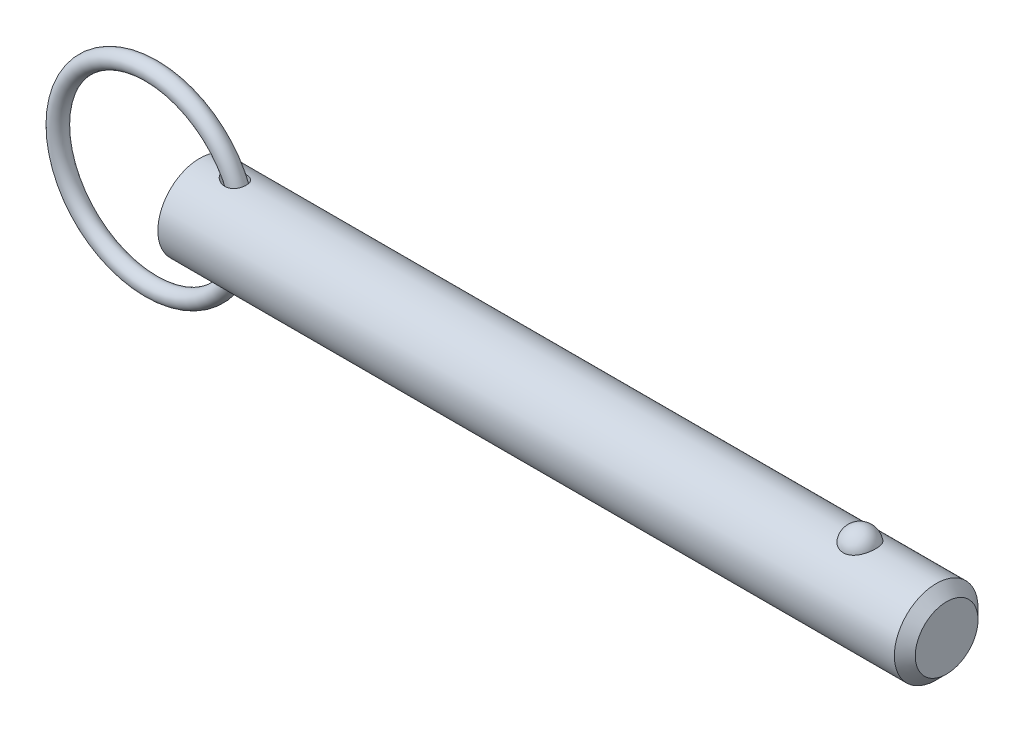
ISO-10303-21;
HEADER;
FILE_DESCRIPTION(('STEP AP214'),'2;1');
FILE_NAME('part.step','',(''),(''),'','','');
FILE_SCHEMA(('AUTOMOTIVE_DESIGN { 1 0 10303 214 1 1 1 1 }'));
ENDSEC;
DATA;
#1=APPLICATION_CONTEXT('core data for automotive mechanical design processes');
#2=APPLICATION_PROTOCOL_DEFINITION('international standard','automotive_design',2000,#1);
#3=PRODUCT_CONTEXT('',#1,'mechanical');
#4=PRODUCT('Part','Part','',(#3));
#5=PRODUCT_RELATED_PRODUCT_CATEGORY('part','',(#4));
#6=PRODUCT_DEFINITION_FORMATION('','',#4);
#7=PRODUCT_DEFINITION_CONTEXT('part definition',#1,'design');
#8=PRODUCT_DEFINITION('design','',#6,#7);
#9=PRODUCT_DEFINITION_SHAPE('','',#8);
#10=(LENGTH_UNIT() NAMED_UNIT(*) SI_UNIT(.MILLI.,.METRE.));
#11=(NAMED_UNIT(*) PLANE_ANGLE_UNIT() SI_UNIT($,.RADIAN.));
#12=(NAMED_UNIT(*) SI_UNIT($,.STERADIAN.) SOLID_ANGLE_UNIT());
#13=UNCERTAINTY_MEASURE_WITH_UNIT(LENGTH_MEASURE(1.E-05),#10,'distance_accuracy_value','');
#14=(GEOMETRIC_REPRESENTATION_CONTEXT(3) GLOBAL_UNCERTAINTY_ASSIGNED_CONTEXT((#13)) GLOBAL_UNIT_ASSIGNED_CONTEXT((#10,
#11,#12)) REPRESENTATION_CONTEXT('',''));
#15=CARTESIAN_POINT('',(0.,0.,0.));
#16=DIRECTION('',(0.,0.,1.));
#17=DIRECTION('',(1.,0.,0.));
#18=AXIS2_PLACEMENT_3D('',#15,#16,#17);
#19=CARTESIAN_POINT('',(-8.23730968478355,0.,0.));
#20=DIRECTION('',(0.,0.,1.));
#21=DIRECTION('',(1.,0.,0.));
#22=AXIS2_PLACEMENT_3D('',#19,#20,#21);
#23=TOROIDAL_SURFACE('',#22,15.875,1.422);
#24=CARTESIAN_POINT('',(9.05969031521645,0.,0.));
#25=VERTEX_POINT('',#24);
#26=VERTEX_LOOP('',#25);
#27=FACE_BOUND('',#26,.T.);
#28=ADVANCED_FACE('P0_F12',(#27),#23,.T.);
#29=CLOSED_SHELL('',(#28));
#30=MANIFOLD_SOLID_BREP('P0_B1',#29);
#31=CARTESIAN_POINT('',(0.,0.,0.));
#32=DIRECTION('',(1.,0.,0.));
#33=DIRECTION('',(0.,0.,-1.));
#34=AXIS2_PLACEMENT_3D('',#31,#32,#33);
#35=CYLINDRICAL_SURFACE('',#34,7.11);
#36=CARTESIAN_POINT('',(3.98467340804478,7.10072679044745,-0.363013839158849));
#37=CARTESIAN_POINT('',(4.00971652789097,7.09600153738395,-0.45539194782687));
#38=CARTESIAN_POINT('',(4.04401947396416,7.08958406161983,-0.545230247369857));
#39=CARTESIAN_POINT('',(4.12810160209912,7.07427055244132,-0.717157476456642));
#40=CARTESIAN_POINT('',(4.17791765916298,7.06536861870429,-0.799227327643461));
#41=CARTESIAN_POINT('',(4.28924471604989,7.04620300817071,-0.953469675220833));
#42=CARTESIAN_POINT('',(4.35063580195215,7.035953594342,-1.02573162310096));
#43=CARTESIAN_POINT('',(4.48282610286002,7.01493313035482,-1.16081412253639));
#44=CARTESIAN_POINT('',(4.55362244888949,7.00416223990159,-1.22363754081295));
#45=CARTESIAN_POINT('',(4.71659336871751,6.98090398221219,-1.35055080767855));
#46=CARTESIAN_POINT('',(4.81029272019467,6.96847103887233,-1.41269256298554));
#47=CARTESIAN_POINT('',(5.0057240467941,6.94515366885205,-1.52319699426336));
#48=CARTESIAN_POINT('',(5.10746392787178,6.93427079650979,-1.57154588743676));
#49=CARTESIAN_POINT('',(5.33503739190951,6.91346066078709,-1.66091325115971));
#50=CARTESIAN_POINT('',(5.46199550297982,6.90402388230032,-1.69921932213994));
#51=CARTESIAN_POINT('',(5.72084799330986,6.89024030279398,-1.75428261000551));
#52=CARTESIAN_POINT('',(5.85274301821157,6.88589416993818,-1.77103699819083));
#53=CARTESIAN_POINT('',(6.11557710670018,6.88337277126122,-1.78081990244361));
#54=CARTESIAN_POINT('',(6.24650031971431,6.88510489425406,-1.77420448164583));
#55=CARTESIAN_POINT('',(6.50446311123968,6.89478744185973,-1.73620392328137));
#56=CARTESIAN_POINT('',(6.6315075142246,6.90272978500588,-1.70485097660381));
#57=CARTESIAN_POINT('',(6.85933269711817,6.92243075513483,-1.62281888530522));
#58=CARTESIAN_POINT('',(6.96133251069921,6.93352131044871,-1.5753580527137));
#59=CARTESIAN_POINT('',(7.15436649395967,6.95824811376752,-1.46226310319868));
#60=CARTESIAN_POINT('',(7.24540699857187,6.97188287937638,-1.3966395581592));
#61=CARTESIAN_POINT('',(7.40446019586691,6.99838217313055,-1.25668991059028));
#62=CARTESIAN_POINT('',(7.473875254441,7.01118308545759,-1.18393777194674));
#63=CARTESIAN_POINT('',(7.59904891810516,7.03582803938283,-1.02736918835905));
#64=CARTESIAN_POINT('',(7.65481029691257,7.04767227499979,-0.943554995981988));
#65=CARTESIAN_POINT('',(7.74982438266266,7.06873077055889,-0.76979592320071));
#66=CARTESIAN_POINT('',(7.7894903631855,7.07800861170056,-0.680084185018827));
#67=CARTESIAN_POINT('',(7.85354088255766,7.09334756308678,-0.495102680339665));
#68=CARTESIAN_POINT('',(7.87792559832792,7.09940871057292,-0.399832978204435));
#69=CARTESIAN_POINT('',(7.9108898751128,7.10766731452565,-0.206294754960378));
#70=CARTESIAN_POINT('',(7.91944662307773,7.10985919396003,-0.108022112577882));
#71=CARTESIAN_POINT('',(7.920501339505,7.11012756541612,0.0886168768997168));
#72=CARTESIAN_POINT('',(7.91299895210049,7.10820396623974,0.186983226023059));
#73=CARTESIAN_POINT('',(7.88205794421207,7.10043733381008,0.381270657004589));
#74=CARTESIAN_POINT('',(7.85857985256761,7.09458459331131,0.477185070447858));
#75=CARTESIAN_POINT('',(7.79617406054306,7.07958431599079,0.663575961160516));
#76=CARTESIAN_POINT('',(7.75724672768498,7.07043685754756,0.754052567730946));
#77=CARTESIAN_POINT('',(7.66496731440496,7.04987259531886,0.926798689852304));
#78=CARTESIAN_POINT('',(7.61164530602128,7.0384605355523,1.00908483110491));
#79=CARTESIAN_POINT('',(7.49191707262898,7.01461776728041,1.16333092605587));
#80=CARTESIAN_POINT('',(7.42551210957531,7.00218715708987,1.235291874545));
#81=CARTESIAN_POINT('',(7.28164031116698,6.97770944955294,1.36680167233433));
#82=CARTESIAN_POINT('',(7.20420170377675,6.96566146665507,1.42638126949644));
#83=CARTESIAN_POINT('',(7.0403906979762,6.94319963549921,1.53199377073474));
#84=CARTESIAN_POINT('',(6.95401827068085,6.93278579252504,1.57802663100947));
#85=CARTESIAN_POINT('',(6.7731858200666,6.91444459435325,1.65656940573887));
#86=CARTESIAN_POINT('',(6.67860569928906,6.90656682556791,1.68881327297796));
#87=CARTESIAN_POINT('',(6.48544119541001,6.89422806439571,1.73849768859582));
#88=CARTESIAN_POINT('',(6.38685561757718,6.88976809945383,1.755933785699));
#89=CARTESIAN_POINT('',(6.18089829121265,6.88429907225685,1.77726234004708));
#90=CARTESIAN_POINT('',(6.07340937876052,6.88356485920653,1.78007646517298));
#91=CARTESIAN_POINT('',(5.85921220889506,6.886086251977,1.77029087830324));
#92=CARTESIAN_POINT('',(5.75250426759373,6.88934339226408,1.75768523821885));
#93=CARTESIAN_POINT('',(5.52848027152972,6.89994454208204,1.71563399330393));
#94=CARTESIAN_POINT('',(5.41155168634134,6.90775772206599,1.68424184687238));
#95=CARTESIAN_POINT('',(5.18376466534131,6.92670168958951,1.60454711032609));
#96=CARTESIAN_POINT('',(5.07291446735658,6.9378368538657,1.5562221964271));
#97=CARTESIAN_POINT('',(4.84835244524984,6.96347168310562,1.43744827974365));
#98=CARTESIAN_POINT('',(4.73562531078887,6.97820486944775,1.36517310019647));
#99=CARTESIAN_POINT('',(4.52504912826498,7.00822340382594,1.20158053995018));
#100=CARTESIAN_POINT('',(4.42717478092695,7.02350775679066,1.11029618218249));
#101=CARTESIAN_POINT('',(4.27935716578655,7.04784659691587,0.940654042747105));
#102=CARTESIAN_POINT('',(4.2239722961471,7.05736064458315,0.867099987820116));
#103=CARTESIAN_POINT('',(4.12558347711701,7.07469854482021,0.711919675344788));
#104=CARTESIAN_POINT('',(4.08256922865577,7.0825238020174,0.630300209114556));
#105=CARTESIAN_POINT('',(4.01142860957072,7.09565978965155,0.459428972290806));
#106=CARTESIAN_POINT('',(3.98346043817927,7.10094374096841,0.370107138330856));
#107=CARTESIAN_POINT('',(3.95517285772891,7.1063173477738,0.233358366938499));
#108=CARTESIAN_POINT('',(3.94802115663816,7.1076831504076,0.187321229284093));
#109=CARTESIAN_POINT('',(3.93842121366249,7.10951900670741,0.0947476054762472));
#110=CARTESIAN_POINT('',(3.93597129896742,7.10998937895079,0.0482113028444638));
#111=CARTESIAN_POINT('',(3.93584361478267,7.11001358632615,-0.0598597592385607));
#112=CARTESIAN_POINT('',(3.9399538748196,7.10922402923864,-0.121405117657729));
#113=CARTESIAN_POINT('',(3.95632793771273,7.10609781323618,-0.243320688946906));
#114=CARTESIAN_POINT('',(3.96859135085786,7.10376122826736,-0.303690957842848));
#115=CARTESIAN_POINT('',(3.98467340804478,7.10072679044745,-0.363013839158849));
#116=B_SPLINE_CURVE_WITH_KNOTS('',3,(#36,#37,#38,#39,#40,#41,#42,#43,#44,#45,#46,#47,#48,#49,
#50,#51,#52,#53,#54,#55,#56,#57,#58,#59,#60,#61,#62,#63,#64,#65,#66,#67,#68,#69,#70,#71,#72,#73,
#74,#75,#76,#77,#78,#79,#80,#81,#82,#83,#84,#85,#86,#87,#88,#89,#90,#91,#92,#93,#94,#95,#96,#97,
#98,#99,#100,#101,#102,#103,#104,#105,#106,#107,#108,#109,#110,#111,#112,#113,#114,#115),
.UNSPECIFIED.,.T.,.F.,(4,2,2,2,2,2,2,2,2,2,2,2,2,2,2,2,2,2,2,2,2,2,2,2,2,2,2,2,2,2,2,2,2,2,2,2,
2,2,2,4),(0.,0.287206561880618,0.575101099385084,0.860162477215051,1.14513709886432,
1.48324846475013,1.82169652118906,2.21865672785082,2.6156690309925,3.00665870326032,
3.39714041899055,3.73437585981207,4.07141541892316,4.37402271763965,4.67656849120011,
4.97076150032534,5.26495110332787,5.55956439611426,5.85418421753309,6.14953461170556,
6.44487798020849,6.73960905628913,7.03431171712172,7.32827352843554,7.6222362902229,
7.9216396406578,8.22113296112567,8.54242840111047,8.86384740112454,9.22635035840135,
9.58933304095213,9.99153142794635,10.3930368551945,10.6697219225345,10.9461759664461,
11.2254825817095,11.3650959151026,11.5046595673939,11.6891051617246,11.8735419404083),.UNSPECIFIED.);
#117=CARTESIAN_POINT('',(3.98467340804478,7.10072679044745,-0.363013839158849));
#118=VERTEX_POINT('',#117);
#119=EDGE_CURVE('P1_E40',#118,#118,#116,.T.);
#120=ORIENTED_EDGE('',*,*,#119,.T.);
#121=EDGE_LOOP('',(#120));
#122=FACE_BOUND('',#121,.T.);
#123=CARTESIAN_POINT('',(125.1925,0.,0.));
#124=DIRECTION('',(1.,0.,0.));
#125=DIRECTION('',(0.,0.,-1.));
#126=AXIS2_PLACEMENT_3D('',#123,#124,#125);
#127=CIRCLE('',#126,7.11);
#128=CARTESIAN_POINT('',(125.1925,0.,-7.11));
#129=VERTEX_POINT('',#128);
#130=EDGE_CURVE('P1_E25',#129,#129,#127,.T.);
#131=ORIENTED_EDGE('',*,*,#130,.F.);
#132=EDGE_LOOP('',(#131));
#133=FACE_BOUND('',#132,.T.);
#134=CARTESIAN_POINT('',(0.,0.,0.));
#135=DIRECTION('',(1.,0.,0.));
#136=DIRECTION('',(0.,0.,-1.));
#137=AXIS2_PLACEMENT_3D('',#134,#135,#136);
#138=CIRCLE('',#137,7.11);
#139=CARTESIAN_POINT('',(0.,0.,-7.11));
#140=VERTEX_POINT('',#139);
#141=EDGE_CURVE('P1_E9',#140,#140,#138,.T.);
#142=ORIENTED_EDGE('',*,*,#141,.T.);
#143=EDGE_LOOP('',(#142));
#144=FACE_BOUND('',#143,.T.);
#145=CARTESIAN_POINT('',(112.229258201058,6.5364666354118,2.79762469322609));
#146=CARTESIAN_POINT('',(112.084429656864,6.53647876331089,2.79761243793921));
#147=CARTESIAN_POINT('',(111.939368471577,6.54144531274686,2.78608115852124));
#148=CARTESIAN_POINT('',(111.653292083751,6.56077791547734,2.7402328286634));
#149=CARTESIAN_POINT('',(111.512288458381,6.5751685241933,2.7058562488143));
#150=CARTESIAN_POINT('',(111.23888335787,6.61165072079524,2.61544042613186));
#151=CARTESIAN_POINT('',(111.106460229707,6.63372195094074,2.55945840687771));
#152=CARTESIAN_POINT('',(110.853233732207,6.68316012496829,2.42742958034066));
#153=CARTESIAN_POINT('',(110.732425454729,6.71052481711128,2.35139129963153));
#154=CARTESIAN_POINT('',(110.501637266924,6.76860821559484,2.17866150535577));
#155=CARTESIAN_POINT('',(110.392085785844,6.79940242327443,2.0814234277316));
#156=CARTESIAN_POINT('',(110.19033404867,6.86050242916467,1.87020907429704));
#157=CARTESIAN_POINT('',(110.098139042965,6.89080807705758,1.75622775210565));
#158=CARTESIAN_POINT('',(109.92925478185,6.94923069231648,1.50900646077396));
#159=CARTESIAN_POINT('',(109.853428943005,6.97719213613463,1.37513873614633));
#160=CARTESIAN_POINT('',(109.724206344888,7.02647251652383,1.09584817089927));
#161=CARTESIAN_POINT('',(109.670810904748,7.04779106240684,0.95042465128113));
#162=CARTESIAN_POINT('',(109.587101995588,7.08180248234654,0.650508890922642));
#163=CARTESIAN_POINT('',(109.557025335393,7.09440672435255,0.495940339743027));
#164=CARTESIAN_POINT('',(109.521473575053,7.10935121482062,0.183515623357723));
#165=CARTESIAN_POINT('',(109.515997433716,7.11169189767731,0.0256595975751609));
#166=CARTESIAN_POINT('',(109.529700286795,7.10589702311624,-0.28751219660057));
#167=CARTESIAN_POINT('',(109.54868231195,7.0978451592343,-0.442838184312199));
#168=CARTESIAN_POINT('',(109.61057450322,7.07221860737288,-0.747830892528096));
#169=CARTESIAN_POINT('',(109.653485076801,7.05464375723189,-0.897497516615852));
#170=CARTESIAN_POINT('',(109.762452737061,7.01171031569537,-1.18722864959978));
#171=CARTESIAN_POINT('',(109.828545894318,6.98633960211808,-1.32727778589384));
#172=CARTESIAN_POINT('',(109.982536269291,6.93042258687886,-1.59370324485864));
#173=CARTESIAN_POINT('',(110.070435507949,6.89987580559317,-1.72007829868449));
#174=CARTESIAN_POINT('',(110.266926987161,6.83659510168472,-1.95657345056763));
#175=CARTESIAN_POINT('',(110.375664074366,6.80384697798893,-2.06656957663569));
#176=CARTESIAN_POINT('',(110.610968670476,6.74001831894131,-2.26611005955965));
#177=CARTESIAN_POINT('',(110.737535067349,6.70893767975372,-2.35565569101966));
#178=CARTESIAN_POINT('',(111.002845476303,6.65264442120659,-2.51019726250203));
#179=CARTESIAN_POINT('',(111.141323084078,6.62733449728,-2.57561395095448));
#180=CARTESIAN_POINT('',(111.428519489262,6.58495995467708,-2.68211134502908));
#181=CARTESIAN_POINT('',(111.577234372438,6.56789220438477,-2.7232012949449));
#182=CARTESIAN_POINT('',(111.872626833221,6.54478663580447,-2.77825810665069));
#183=CARTESIAN_POINT('',(112.01902951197,6.53823639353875,-2.79348727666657));
#184=CARTESIAN_POINT('',(112.312470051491,6.53532718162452,-2.80028921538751));
#185=CARTESIAN_POINT('',(112.459507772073,6.53896606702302,-2.79186696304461));
#186=CARTESIAN_POINT('',(112.744921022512,6.55570357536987,-2.75232178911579));
#187=CARTESIAN_POINT('',(112.883422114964,6.56848455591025,-2.72196077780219));
#188=CARTESIAN_POINT('',(113.153114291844,6.60173528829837,-2.64028774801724));
#189=CARTESIAN_POINT('',(113.284304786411,6.62220565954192,-2.58897404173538));
#190=CARTESIAN_POINT('',(113.538846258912,6.66917927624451,-2.4654782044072));
#191=CARTESIAN_POINT('',(113.661969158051,6.69580233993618,-2.39287266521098));
#192=CARTESIAN_POINT('',(113.894441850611,6.75207041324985,-2.22915269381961));
#193=CARTESIAN_POINT('',(114.003788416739,6.78171612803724,-2.13803393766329));
#194=CARTESIAN_POINT('',(114.211642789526,6.84264629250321,-1.93445592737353));
#195=CARTESIAN_POINT('',(114.309317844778,6.87393748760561,-1.82114774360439));
#196=CARTESIAN_POINT('',(114.485011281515,6.93345710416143,-1.57947787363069));
#197=CARTESIAN_POINT('',(114.563026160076,6.96168497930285,-1.45111351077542));
#198=CARTESIAN_POINT('',(114.699985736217,7.01307558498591,-1.17842708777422));
#199=CARTESIAN_POINT('',(114.758258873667,7.03605262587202,-1.03373189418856));
#200=CARTESIAN_POINT('',(114.851081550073,7.07340932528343,-0.735867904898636));
#201=CARTESIAN_POINT('',(114.885631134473,7.08778900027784,-0.582699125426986));
#202=CARTESIAN_POINT('',(114.930274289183,7.10647639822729,-0.272420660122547));
#203=CARTESIAN_POINT('',(114.94039710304,7.11079616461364,-0.115315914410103));
#204=CARTESIAN_POINT('',(114.936061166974,7.10896059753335,0.198488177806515));
#205=CARTESIAN_POINT('',(114.921603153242,7.10280557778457,0.355187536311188));
#206=CARTESIAN_POINT('',(114.868572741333,7.08071500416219,0.662724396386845));
#207=CARTESIAN_POINT('',(114.83015058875,7.06484039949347,0.813592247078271));
#208=CARTESIAN_POINT('',(114.730101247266,7.02495896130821,1.10629159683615));
#209=CARTESIAN_POINT('',(114.668472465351,7.00095156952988,1.24812247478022));
#210=CARTESIAN_POINT('',(114.522766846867,6.94706632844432,1.51976439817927));
#211=CARTESIAN_POINT('',(114.438544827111,6.91715085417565,1.64949012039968));
#212=CARTESIAN_POINT('',(114.249586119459,6.8547056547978,1.89231285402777));
#213=CARTESIAN_POINT('',(114.144850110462,6.82217601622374,2.00541041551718));
#214=CARTESIAN_POINT('',(113.917103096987,6.75805358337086,2.21190674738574));
#215=CARTESIAN_POINT('',(113.794082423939,6.72646129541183,2.30529503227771));
#216=CARTESIAN_POINT('',(113.53273470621,6.66789520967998,2.46959908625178));
#217=CARTESIAN_POINT('',(113.394401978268,6.64092313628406,2.54050647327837));
#218=CARTESIAN_POINT('',(113.111182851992,6.59572583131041,2.65560045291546));
#219=CARTESIAN_POINT('',(112.966666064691,6.57724013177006,2.70059539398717));
#220=CARTESIAN_POINT('',(112.671546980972,6.55006426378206,2.76587321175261));
#221=CARTESIAN_POINT('',(112.520964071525,6.54134511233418,2.78622922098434));
#222=CARTESIAN_POINT('',(112.323046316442,6.53697847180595,2.79642434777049));
#223=CARTESIAN_POINT('',(112.276164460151,6.53646270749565,2.79762866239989));
#224=CARTESIAN_POINT('',(112.229258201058,6.5364666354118,2.79762469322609));
#225=B_SPLINE_CURVE_WITH_KNOTS('',3,(#145,#146,#147,#148,#149,#150,#151,#152,#153,#154,#155,
#156,#157,#158,#159,#160,#161,#162,#163,#164,#165,#166,#167,#168,#169,#170,#171,#172,#173,#174,
#175,#176,#177,#178,#179,#180,#181,#182,#183,#184,#185,#186,#187,#188,#189,#190,#191,#192,#193,
#194,#195,#196,#197,#198,#199,#200,#201,#202,#203,#204,#205,#206,#207,#208,#209,#210,#211,#212,
#213,#214,#215,#216,#217,#218,#219,#220,#221,#222,#223,#224),.UNSPECIFIED.,.T.,.F.,(4,2,2,2,2,2,
2,2,2,2,2,2,2,2,2,2,2,2,2,2,2,2,2,2,2,2,2,2,2,2,2,2,2,2,2,2,2,2,2,4),(0.,0.434355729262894,
0.869847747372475,1.30419416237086,1.73835621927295,2.18541922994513,2.63261726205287,
3.09954261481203,3.56649542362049,4.03813031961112,4.5097452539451,4.97758575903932,
5.44543423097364,5.9140138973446,6.38263700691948,6.85464418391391,7.32662193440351,
7.78992971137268,8.25306131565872,8.69285754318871,9.13256119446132,9.5576862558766,
9.9828455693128,10.4171106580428,10.8514772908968,11.3079089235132,11.7644218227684,
12.2351898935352,12.7059570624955,13.1761603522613,13.6463495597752,14.1136200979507,
14.580922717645,15.0513032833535,15.5216682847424,15.9922828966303,16.4630727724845,
16.9182457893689,17.3720644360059,17.5127411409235),.UNSPECIFIED.);
#226=CARTESIAN_POINT('',(112.229258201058,6.5364666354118,2.79762469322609));
#227=VERTEX_POINT('',#226);
#228=EDGE_CURVE('P1_E34',#227,#227,#225,.T.);
#229=ORIENTED_EDGE('',*,*,#228,.T.);
#230=EDGE_LOOP('',(#229));
#231=FACE_BOUND('',#230,.T.);
#232=CARTESIAN_POINT('',(3.98467340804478,-7.10072679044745,-0.363013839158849));
#233=CARTESIAN_POINT('',(3.96426456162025,-7.10457733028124,-0.287714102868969));
#234=CARTESIAN_POINT('',(3.95000501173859,-7.10730349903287,-0.210695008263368));
#235=CARTESIAN_POINT('',(3.93481801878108,-7.11020840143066,-0.0553038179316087));
#236=CARTESIAN_POINT('',(3.93388435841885,-7.11038832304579,0.0230676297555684));
#237=CARTESIAN_POINT('',(3.94541910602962,-7.10817995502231,0.178714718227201));
#238=CARTESIAN_POINT('',(3.95787987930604,-7.10579312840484,0.25599095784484));
#239=CARTESIAN_POINT('',(3.99523775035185,-7.09872642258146,0.407352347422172));
#240=CARTESIAN_POINT('',(4.02014065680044,-7.09404547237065,0.481435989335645));
#241=CARTESIAN_POINT('',(4.08119600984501,-7.08278363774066,0.625775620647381));
#242=CARTESIAN_POINT('',(4.11749458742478,-7.07617815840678,0.695967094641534));
#243=CARTESIAN_POINT('',(4.19940836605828,-7.06165305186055,0.830508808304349));
#244=CARTESIAN_POINT('',(4.24502952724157,-7.0537325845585,0.894855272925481));
#245=CARTESIAN_POINT('',(4.36790232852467,-7.03310314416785,1.04688574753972));
#246=CARTESIAN_POINT('',(4.44977459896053,-7.01993229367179,1.13078695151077));
#247=CARTESIAN_POINT('',(4.62610796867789,-6.99351259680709,1.28411726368));
#248=CARTESIAN_POINT('',(4.7205898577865,-6.98026365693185,1.35352197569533));
#249=CARTESIAN_POINT('',(4.92036507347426,-6.9549104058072,1.47831921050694));
#250=CARTESIAN_POINT('',(5.02579054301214,-6.94282458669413,1.53350332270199));
#251=CARTESIAN_POINT('',(5.24378330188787,-6.92129098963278,1.62793610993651));
#252=CARTESIAN_POINT('',(5.35635066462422,-6.91184323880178,1.66718462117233));
#253=CARTESIAN_POINT('',(5.60134354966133,-6.89573491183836,1.73269893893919));
#254=CARTESIAN_POINT('',(5.73444697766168,-6.8895970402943,1.75661057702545));
#255=CARTESIAN_POINT('',(6.00300738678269,-6.88344616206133,1.78057487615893));
#256=CARTESIAN_POINT('',(6.13846360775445,-6.88343121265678,1.78063510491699));
#257=CARTESIAN_POINT('',(6.39660470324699,-6.88981379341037,1.75576480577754));
#258=CARTESIAN_POINT('',(6.51947843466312,-6.89572457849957,1.73273121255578));
#259=CARTESIAN_POINT('',(6.75813770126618,-6.91274434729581,1.66352936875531));
#260=CARTESIAN_POINT('',(6.87393155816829,-6.92384709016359,1.61738888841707));
#261=CARTESIAN_POINT('',(7.07801861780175,-6.94787316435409,1.51052664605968));
#262=CARTESIAN_POINT('',(7.16789841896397,-6.96033024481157,1.45271574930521));
#263=CARTESIAN_POINT('',(7.33546773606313,-6.98638661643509,1.32171912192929));
#264=CARTESIAN_POINT('',(7.41316182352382,-6.99998547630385,1.24853918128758));
#265=CARTESIAN_POINT('',(7.54861420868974,-7.02559503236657,1.09486170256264));
#266=CARTESIAN_POINT('',(7.60741145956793,-7.03764930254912,1.01528346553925));
#267=CARTESIAN_POINT('',(7.71070740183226,-7.0598657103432,0.847099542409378));
#268=CARTESIAN_POINT('',(7.75520788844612,-7.0700280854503,0.758494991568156));
#269=CARTESIAN_POINT('',(7.82836147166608,-7.08722075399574,0.575936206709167));
#270=CARTESIAN_POINT('',(7.85719783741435,-7.09428707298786,0.482058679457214));
#271=CARTESIAN_POINT('',(7.89918378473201,-7.10470260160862,0.29065874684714));
#272=CARTESIAN_POINT('',(7.91233308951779,-7.10805174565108,0.193136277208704));
#273=CARTESIAN_POINT('',(7.92267451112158,-7.11067890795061,-0.00313968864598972));
#274=CARTESIAN_POINT('',(7.91981203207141,-7.10994299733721,-0.10189624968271));
#275=CARTESIAN_POINT('',(7.89806489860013,-7.10444651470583,-0.297516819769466));
#276=CARTESIAN_POINT('',(7.87918005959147,-7.09968589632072,-0.394380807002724));
#277=CARTESIAN_POINT('',(7.82577988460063,-7.0866471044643,-0.58355375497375));
#278=CARTESIAN_POINT('',(7.79124976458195,-7.07836560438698,-0.675858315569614));
#279=CARTESIAN_POINT('',(7.70736343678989,-7.05919003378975,-0.853167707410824));
#280=CARTESIAN_POINT('',(7.65800801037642,-7.04829610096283,-0.938172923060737));
#281=CARTESIAN_POINT('',(7.54590141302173,-7.02513961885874,-1.09819812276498));
#282=CARTESIAN_POINT('',(7.48319521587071,-7.01288172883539,-1.17325029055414));
#283=CARTESIAN_POINT('',(7.34599775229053,-6.98832192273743,-1.31164333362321));
#284=CARTESIAN_POINT('',(7.27150757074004,-6.97602001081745,-1.37498528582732));
#285=CARTESIAN_POINT('',(7.11277776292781,-6.95268608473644,-1.48849974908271));
#286=CARTESIAN_POINT('',(7.02852525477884,-6.94165578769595,-1.53865456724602));
#287=CARTESIAN_POINT('',(6.85282430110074,-6.92200320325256,-1.62478650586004));
#288=CARTESIAN_POINT('',(6.76137511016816,-6.91338116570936,-1.66076215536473));
#289=CARTESIAN_POINT('',(6.57061179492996,-6.89906044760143,-1.71930563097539));
#290=CARTESIAN_POINT('',(6.47113516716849,-6.89347290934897,-1.74136795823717));
#291=CARTESIAN_POINT('',(6.26989833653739,-6.88605020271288,-1.7704895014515));
#292=CARTESIAN_POINT('',(6.16813737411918,-6.88421630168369,-1.77754365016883));
#293=CARTESIAN_POINT('',(5.95492537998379,-6.88424071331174,-1.77745174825));
#294=CARTESIAN_POINT('',(5.8434768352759,-6.88646827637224,-1.76888555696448));
#295=CARTESIAN_POINT('',(5.62307560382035,-6.89483827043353,-1.73596677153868));
#296=CARTESIAN_POINT('',(5.51412477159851,-6.90098351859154,-1.71160281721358));
#297=CARTESIAN_POINT('',(5.28644478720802,-6.91743803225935,-1.64393691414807));
#298=CARTESIAN_POINT('',(5.16837217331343,-6.92819628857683,-1.59852806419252));
#299=CARTESIAN_POINT('',(4.94091825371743,-6.95234836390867,-1.4899796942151));
#300=CARTESIAN_POINT('',(4.83153887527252,-6.96574276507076,-1.42683625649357));
#301=CARTESIAN_POINT('',(4.63576710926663,-6.99209234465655,-1.29112257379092));
#302=CARTESIAN_POINT('',(4.54816728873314,-7.00494184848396,-1.22027748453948));
#303=CARTESIAN_POINT('',(4.38554897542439,-7.03019055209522,-1.0652111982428));
#304=CARTESIAN_POINT('',(4.31052141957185,-7.04259007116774,-0.980999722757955));
#305=CARTESIAN_POINT('',(4.18551811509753,-7.0640229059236,-0.811206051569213));
#306=CARTESIAN_POINT('',(4.13358417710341,-7.07328321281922,-0.727107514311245));
#307=CARTESIAN_POINT('',(4.04607461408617,-7.0891994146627,-0.550580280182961));
#308=CARTESIAN_POINT('',(4.01046401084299,-7.09586087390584,-0.458169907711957));
#309=CARTESIAN_POINT('',(3.98467340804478,-7.10072679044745,-0.363013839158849));
#310=B_SPLINE_CURVE_WITH_KNOTS('',3,(#232,#233,#234,#235,#236,#237,#238,#239,#240,#241,#242,
#243,#244,#245,#246,#247,#248,#249,#250,#251,#252,#253,#254,#255,#256,#257,#258,#259,#260,#261,
#262,#263,#264,#265,#266,#267,#268,#269,#270,#271,#272,#273,#274,#275,#276,#277,#278,#279,#280,
#281,#282,#283,#284,#285,#286,#287,#288,#289,#290,#291,#292,#293,#294,#295,#296,#297,#298,#299,
#300,#301,#302,#303,#304,#305,#306,#307,#308,#309),.UNSPECIFIED.,.T.,.F.,(4,2,2,2,2,2,2,2,2,2,2,
2,2,2,2,2,2,2,2,2,2,2,2,2,2,2,2,2,2,2,2,2,2,2,2,2,2,2,4),(0.,0.23402065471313,0.467932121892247,
0.701710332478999,0.935597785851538,1.17261620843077,1.40978663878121,1.76177576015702,
2.11435255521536,2.47183528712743,2.8293216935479,3.23332937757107,3.63720887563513,
4.01042610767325,4.38319587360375,4.70425151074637,5.02518641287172,5.32277979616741,
5.62033579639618,5.91433101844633,6.2083314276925,6.50333490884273,6.79834178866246,
7.09362801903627,7.38889868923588,7.6831900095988,7.9774542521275,8.27211131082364,
8.56679892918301,8.8716552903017,9.17661456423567,9.51069129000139,9.84500851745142,
10.2243046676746,10.6036846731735,10.9425776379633,11.2812252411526,11.5775945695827,
11.8733258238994),.UNSPECIFIED.);
#311=CARTESIAN_POINT('',(3.98467340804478,-7.10072679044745,-0.363013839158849));
#312=VERTEX_POINT('',#311);
#313=EDGE_CURVE('P1_E17',#312,#312,#310,.T.);
#314=ORIENTED_EDGE('',*,*,#313,.T.);
#315=EDGE_LOOP('',(#314));
#316=FACE_BOUND('',#315,.T.);
#317=ADVANCED_FACE('P1_F13',(#122,#133,#144,#231,#316),#35,.T.);
#318=CARTESIAN_POINT('',(0.,0.,0.));
#319=DIRECTION('',(-1.,0.,0.));
#320=DIRECTION('',(0.,0.,1.));
#321=AXIS2_PLACEMENT_3D('',#318,#319,#320);
#322=PLANE('',#321);
#323=ORIENTED_EDGE('',*,*,#141,.F.);
#324=EDGE_LOOP('',(#323));
#325=FACE_BOUND('',#324,.T.);
#326=ADVANCED_FACE('P1_F15',(#325),#322,.T.);
#327=CARTESIAN_POINT('',(126.97,0.,0.));
#328=DIRECTION('',(-1.,0.,0.));
#329=DIRECTION('',(0.,0.,1.));
#330=AXIS2_PLACEMENT_3D('',#327,#328,#329);
#331=CONICAL_SURFACE('',#330,5.33250000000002,0.785398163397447);
#332=ORIENTED_EDGE('',*,*,#130,.T.);
#333=EDGE_LOOP('',(#332));
#334=FACE_BOUND('',#333,.T.);
#335=CARTESIAN_POINT('',(126.97,0.,0.));
#336=DIRECTION('',(1.,0.,0.));
#337=DIRECTION('',(0.,0.,-1.));
#338=AXIS2_PLACEMENT_3D('',#335,#336,#337);
#339=CIRCLE('',#338,5.33250000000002);
#340=CARTESIAN_POINT('',(126.97,0.,-5.33250000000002));
#341=VERTEX_POINT('',#340);
#342=EDGE_CURVE('P1_E30',#341,#341,#339,.T.);
#343=ORIENTED_EDGE('',*,*,#342,.F.);
#344=EDGE_LOOP('',(#343));
#345=FACE_BOUND('',#344,.T.);
#346=ADVANCED_FACE('P1_F55',(#334,#345),#331,.T.);
#347=CARTESIAN_POINT('',(126.97,5.33250000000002,0.));
#348=DIRECTION('',(1.,0.,0.));
#349=DIRECTION('',(0.,0.,-1.));
#350=AXIS2_PLACEMENT_3D('',#347,#348,#349);
#351=PLANE('',#350);
#352=ORIENTED_EDGE('',*,*,#342,.T.);
#353=EDGE_LOOP('',(#352));
#354=FACE_BOUND('',#353,.T.);
#355=ADVANCED_FACE('P1_F51',(#354),#351,.T.);
#356=CARTESIAN_POINT('',(112.229258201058,6.399,0.));
#357=DIRECTION('',(-1.,0.,0.));
#358=DIRECTION('',(0.,1.,0.));
#359=AXIS2_PLACEMENT_3D('',#356,#357,#358);
#360=SPHERICAL_SURFACE('',#359,2.80099999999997);
#361=ORIENTED_EDGE('',*,*,#228,.F.);
#362=EDGE_LOOP('',(#361));
#363=FACE_BOUND('',#362,.T.);
#364=ADVANCED_FACE('P1_F46',(#363),#360,.T.);
#365=CARTESIAN_POINT('',(-8.23730968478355,0.,0.));
#366=DIRECTION('',(0.,0.,1.));
#367=DIRECTION('',(1.,0.,0.));
#368=AXIS2_PLACEMENT_3D('',#365,#366,#367);
#369=TOROIDAL_SURFACE('',#368,15.875,1.7775);
#370=ORIENTED_EDGE('',*,*,#313,.F.);
#371=EDGE_LOOP('',(#370));
#372=FACE_BOUND('',#371,.T.);
#373=ORIENTED_EDGE('',*,*,#119,.F.);
#374=EDGE_LOOP('',(#373));
#375=FACE_BOUND('',#374,.T.);
#376=ADVANCED_FACE('P1_F50',(#372,#375),#369,.F.);
#377=CLOSED_SHELL('',(#317,#326,#346,#355,#364,#376));
#378=MANIFOLD_SOLID_BREP('P1_B1',#377);
#379=ADVANCED_BREP_SHAPE_REPRESENTATION('',(#18,#30,#378),#14);
#380=SHAPE_DEFINITION_REPRESENTATION(#9,#379);
ENDSEC;
END-ISO-10303-21;
